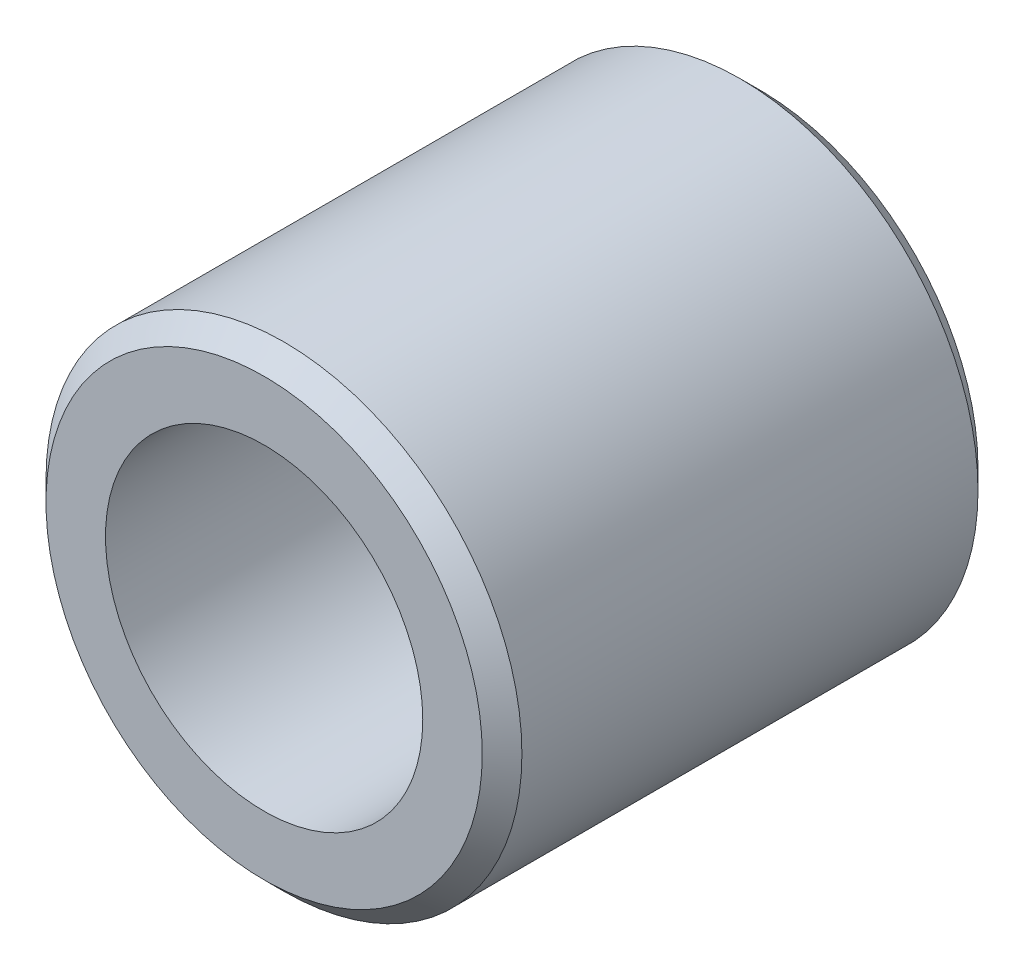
from build123d import *

# Parameters (mm, degrees)
ESQUISSE1_R      = 6
ESQUISSE1_R_2    = 4
EXTRUSION1_DEPTH = 12.5
CHANFREIN1_SIZE  = 0.5


with BuildPart() as part:
    # Esquisse1 → Extrusion1 (new body)
    with BuildSketch(Plane.XY):
        Circle(ESQUISSE1_R)
        Circle(ESQUISSE1_R_2, mode=Mode.SUBTRACT)
    extrude(amount=EXTRUSION1_DEPTH)

    # Chanfrein1
    chanfrein1_edges = [part.edges().sort_by_distance(p)[0] for p in [
        (-6, 0, 0),
        (-6, 0, 12.5),
    ]]
    chamfer(chanfrein1_edges, length=CHANFREIN1_SIZE)


solid = part.part
